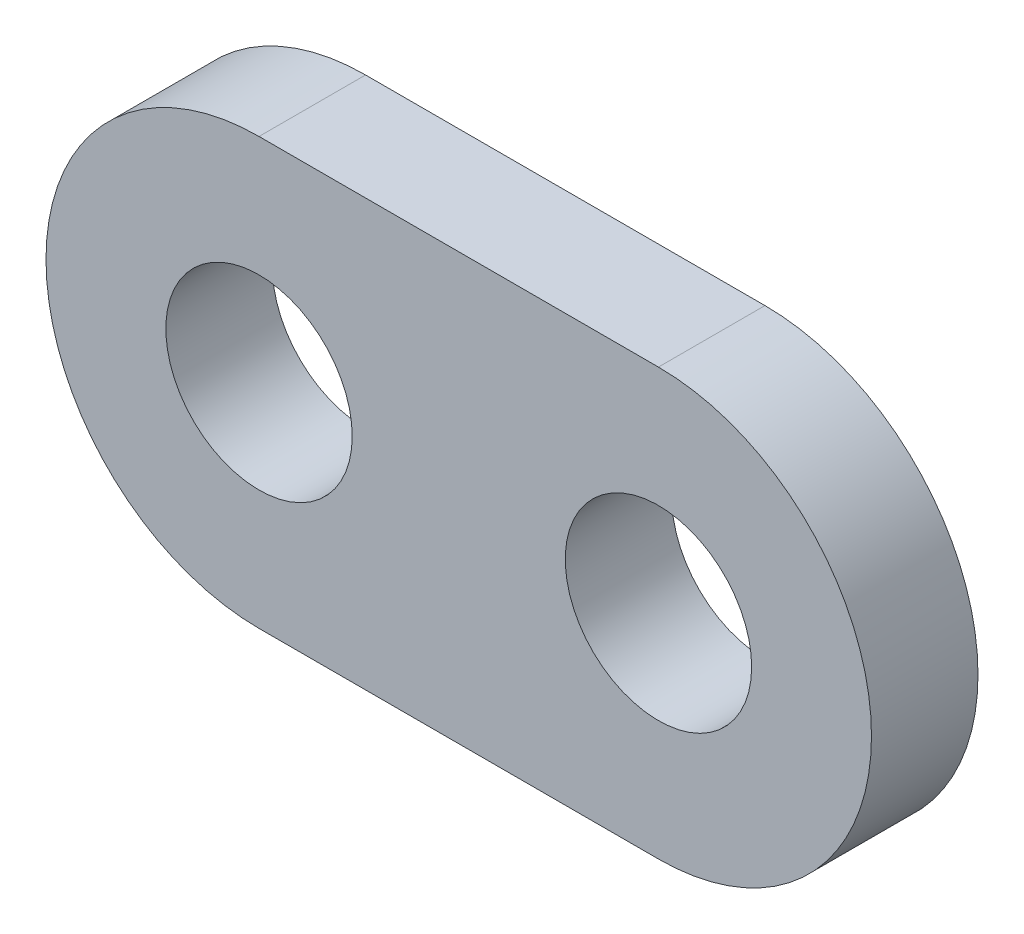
from build123d import *

# Parameters (mm, degrees)
SKETCH1_R      = 17.5
EXTRUDE1_DEPTH = 20


with BuildPart() as part:
    # Sketch1 → Extrude1 (new body)
    with BuildSketch(Plane.XY):
        with BuildLine():
            Line((0, 0), (75, 0))
            ThreePointArc((75, 0), (115, 40), (75, 80))
            Line((75, 80), (0, 80))
            ThreePointArc((0, 80), (-40, 40), (0, 0))
        make_face()
        with Locations((0, 40)):
            Circle(SKETCH1_R, mode=Mode.SUBTRACT)
        with Locations((75, 40)):
            Circle(SKETCH1_R, mode=Mode.SUBTRACT)
    extrude(amount=EXTRUDE1_DEPTH)


solid = part.part
